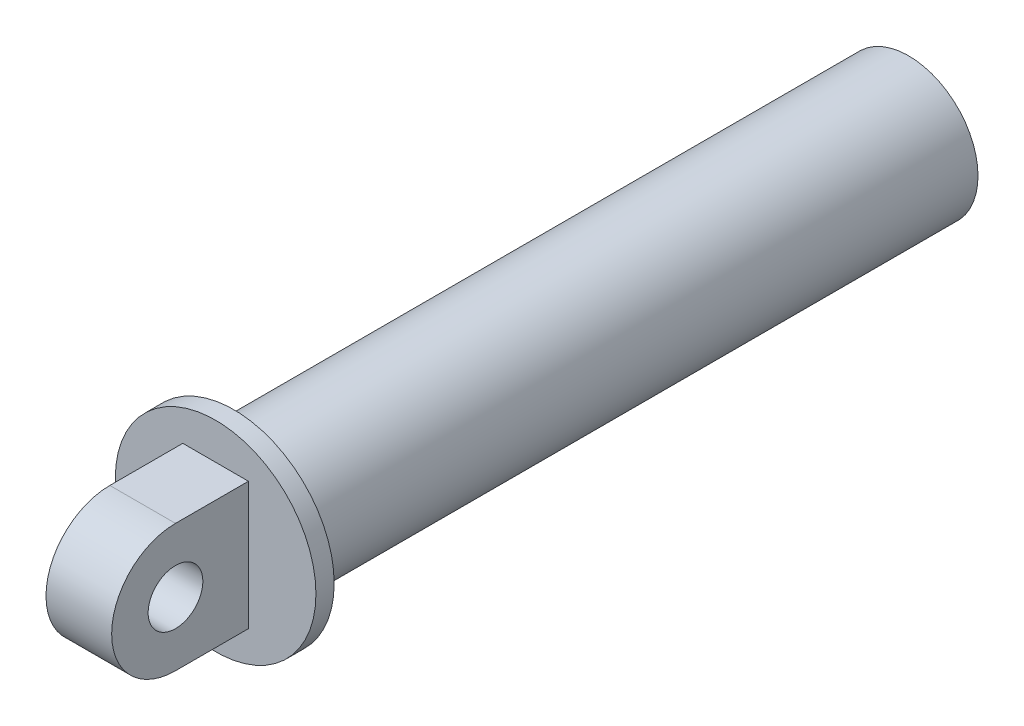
ISO-10303-21;
HEADER;
FILE_DESCRIPTION(('STEP AP214'),'2;1');
FILE_NAME('part.step','',(''),(''),'','','');
FILE_SCHEMA(('AUTOMOTIVE_DESIGN { 1 0 10303 214 1 1 1 1 }'));
ENDSEC;
DATA;
#1=APPLICATION_CONTEXT('core data for automotive mechanical design processes');
#2=APPLICATION_PROTOCOL_DEFINITION('international standard','automotive_design',2000,#1);
#3=PRODUCT_CONTEXT('',#1,'mechanical');
#4=PRODUCT('Part','Part','',(#3));
#5=PRODUCT_RELATED_PRODUCT_CATEGORY('part','',(#4));
#6=PRODUCT_DEFINITION_FORMATION('','',#4);
#7=PRODUCT_DEFINITION_CONTEXT('part definition',#1,'design');
#8=PRODUCT_DEFINITION('design','',#6,#7);
#9=PRODUCT_DEFINITION_SHAPE('','',#8);
#10=(LENGTH_UNIT() NAMED_UNIT(*) SI_UNIT(.MILLI.,.METRE.));
#11=(NAMED_UNIT(*) PLANE_ANGLE_UNIT() SI_UNIT($,.RADIAN.));
#12=(NAMED_UNIT(*) SI_UNIT($,.STERADIAN.) SOLID_ANGLE_UNIT());
#13=UNCERTAINTY_MEASURE_WITH_UNIT(LENGTH_MEASURE(1.E-05),#10,'distance_accuracy_value','');
#14=(GEOMETRIC_REPRESENTATION_CONTEXT(3) GLOBAL_UNCERTAINTY_ASSIGNED_CONTEXT((#13)) GLOBAL_UNIT_ASSIGNED_CONTEXT((#10,
#11,#12)) REPRESENTATION_CONTEXT('',''));
#15=CARTESIAN_POINT('',(0.,0.,0.));
#16=DIRECTION('',(0.,0.,1.));
#17=DIRECTION('',(1.,0.,0.));
#18=AXIS2_PLACEMENT_3D('',#15,#16,#17);
#19=CARTESIAN_POINT('',(0.,0.,380.));
#20=DIRECTION('',(0.,0.,1.));
#21=DIRECTION('',(1.,0.,0.));
#22=AXIS2_PLACEMENT_3D('',#19,#20,#21);
#23=PLANE('',#22);
#24=CARTESIAN_POINT('',(0.,0.,380.));
#25=DIRECTION('',(0.,0.,1.));
#26=DIRECTION('',(1.,0.,0.));
#27=AXIS2_PLACEMENT_3D('',#24,#25,#26);
#28=CIRCLE('',#27,55.);
#29=CARTESIAN_POINT('',(55.,0.,380.));
#30=VERTEX_POINT('',#29);
#31=EDGE_CURVE('E125',#30,#30,#28,.T.);
#32=ORIENTED_EDGE('',*,*,#31,.T.);
#33=EDGE_LOOP('',(#32));
#34=FACE_BOUND('',#33,.T.);
#35=DIRECTION('',(0.,1.,0.));
#36=VECTOR('',#35,1.);
#37=CARTESIAN_POINT('',(18.,35.,380.));
#38=LINE('',#37,#36);
#39=CARTESIAN_POINT('',(18.,-35.,380.));
#40=VERTEX_POINT('',#39);
#41=CARTESIAN_POINT('',(18.,35.,380.));
#42=VERTEX_POINT('',#41);
#43=EDGE_CURVE('E116',#40,#42,#38,.T.);
#44=ORIENTED_EDGE('',*,*,#43,.F.);
#45=DIRECTION('',(-1.,0.,0.));
#46=VECTOR('',#45,1.);
#47=CARTESIAN_POINT('',(18.,-35.,380.));
#48=LINE('',#47,#46);
#49=CARTESIAN_POINT('',(-18.,-35.,380.));
#50=VERTEX_POINT('',#49);
#51=EDGE_CURVE('E98',#40,#50,#48,.T.);
#52=ORIENTED_EDGE('',*,*,#51,.T.);
#53=DIRECTION('',(0.,1.,0.));
#54=VECTOR('',#53,1.);
#55=CARTESIAN_POINT('',(-18.,35.,380.));
#56=LINE('',#55,#54);
#57=CARTESIAN_POINT('',(-18.,35.,380.));
#58=VERTEX_POINT('',#57);
#59=EDGE_CURVE('E86',#50,#58,#56,.T.);
#60=ORIENTED_EDGE('',*,*,#59,.T.);
#61=DIRECTION('',(-1.,0.,0.));
#62=VECTOR('',#61,1.);
#63=CARTESIAN_POINT('',(18.,35.,380.));
#64=LINE('',#63,#62);
#65=EDGE_CURVE('E120',#42,#58,#64,.T.);
#66=ORIENTED_EDGE('',*,*,#65,.F.);
#67=EDGE_LOOP('',(#44,#52,#60,#66));
#68=FACE_BOUND('',#67,.T.);
#69=ADVANCED_FACE('F39',(#34,#68),#23,.T.);
#70=CARTESIAN_POINT('',(0.,0.,0.));
#71=DIRECTION('',(0.,0.,1.));
#72=DIRECTION('',(1.,0.,0.));
#73=AXIS2_PLACEMENT_3D('',#70,#71,#72);
#74=PLANE('',#73);
#75=CARTESIAN_POINT('',(0.,0.,0.));
#76=DIRECTION('',(0.,0.,1.));
#77=DIRECTION('',(1.,0.,0.));
#78=AXIS2_PLACEMENT_3D('',#75,#76,#77);
#79=CIRCLE('',#78,38.);
#80=CARTESIAN_POINT('',(38.,0.,0.));
#81=VERTEX_POINT('',#80);
#82=EDGE_CURVE('E131',#81,#81,#79,.T.);
#83=ORIENTED_EDGE('',*,*,#82,.F.);
#84=EDGE_LOOP('',(#83));
#85=FACE_BOUND('',#84,.T.);
#86=CARTESIAN_POINT('',(0.,0.,0.));
#87=DIRECTION('',(0.,0.,1.));
#88=DIRECTION('',(1.,0.,0.));
#89=AXIS2_PLACEMENT_3D('',#86,#87,#88);
#90=CIRCLE('',#89,30.);
#91=CARTESIAN_POINT('',(30.,0.,0.));
#92=VERTEX_POINT('',#91);
#93=EDGE_CURVE('E128',#92,#92,#90,.T.);
#94=ORIENTED_EDGE('',*,*,#93,.T.);
#95=EDGE_LOOP('',(#94));
#96=FACE_BOUND('',#95,.T.);
#97=ADVANCED_FACE('F141',(#85,#96),#74,.F.);
#98=CARTESIAN_POINT('',(0.,0.,370.));
#99=DIRECTION('',(0.,0.,-1.));
#100=DIRECTION('',(-1.,0.,0.));
#101=AXIS2_PLACEMENT_3D('',#98,#99,#100);
#102=CYLINDRICAL_SURFACE('',#101,38.);
#103=CARTESIAN_POINT('',(0.,0.,370.));
#104=DIRECTION('',(0.,0.,1.));
#105=DIRECTION('',(1.,0.,0.));
#106=AXIS2_PLACEMENT_3D('',#103,#104,#105);
#107=CIRCLE('',#106,38.);
#108=CARTESIAN_POINT('',(38.,0.,370.));
#109=VERTEX_POINT('',#108);
#110=EDGE_CURVE('E47',#109,#109,#107,.T.);
#111=ORIENTED_EDGE('',*,*,#110,.F.);
#112=EDGE_LOOP('',(#111));
#113=FACE_BOUND('',#112,.T.);
#114=ORIENTED_EDGE('',*,*,#82,.T.);
#115=EDGE_LOOP('',(#114));
#116=FACE_BOUND('',#115,.T.);
#117=ADVANCED_FACE('F41',(#113,#116),#102,.T.);
#118=CARTESIAN_POINT('',(0.,0.,370.));
#119=DIRECTION('',(0.,0.,-1.));
#120=DIRECTION('',(-1.,0.,0.));
#121=AXIS2_PLACEMENT_3D('',#118,#119,#120);
#122=CYLINDRICAL_SURFACE('',#121,30.);
#123=CARTESIAN_POINT('',(0.,0.,350.));
#124=DIRECTION('',(0.,0.,-1.));
#125=DIRECTION('',(-1.,0.,0.));
#126=AXIS2_PLACEMENT_3D('',#123,#124,#125);
#127=CIRCLE('',#126,30.);
#128=CARTESIAN_POINT('',(-30.,0.,350.));
#129=VERTEX_POINT('',#128);
#130=EDGE_CURVE('E11',#129,#129,#127,.T.);
#131=ORIENTED_EDGE('',*,*,#130,.F.);
#132=EDGE_LOOP('',(#131));
#133=FACE_BOUND('',#132,.T.);
#134=ORIENTED_EDGE('',*,*,#93,.F.);
#135=EDGE_LOOP('',(#134));
#136=FACE_BOUND('',#135,.T.);
#137=ADVANCED_FACE('F140',(#133,#136),#122,.F.);
#138=CARTESIAN_POINT('',(0.,0.,370.));
#139=DIRECTION('',(0.,0.,1.));
#140=DIRECTION('',(1.,0.,0.));
#141=AXIS2_PLACEMENT_3D('',#138,#139,#140);
#142=PLANE('',#141);
#143=CARTESIAN_POINT('',(0.,0.,370.));
#144=DIRECTION('',(0.,0.,1.));
#145=DIRECTION('',(1.,0.,0.));
#146=AXIS2_PLACEMENT_3D('',#143,#144,#145);
#147=CIRCLE('',#146,55.);
#148=CARTESIAN_POINT('',(55.,0.,370.));
#149=VERTEX_POINT('',#148);
#150=EDGE_CURVE('E97',#149,#149,#147,.T.);
#151=ORIENTED_EDGE('',*,*,#150,.F.);
#152=EDGE_LOOP('',(#151));
#153=FACE_BOUND('',#152,.T.);
#154=ORIENTED_EDGE('',*,*,#110,.T.);
#155=EDGE_LOOP('',(#154));
#156=FACE_BOUND('',#155,.T.);
#157=ADVANCED_FACE('F136',(#153,#156),#142,.F.);
#158=CARTESIAN_POINT('',(0.,0.,380.));
#159=DIRECTION('',(0.,0.,-1.));
#160=DIRECTION('',(-1.,0.,0.));
#161=AXIS2_PLACEMENT_3D('',#158,#159,#160);
#162=CYLINDRICAL_SURFACE('',#161,55.);
#163=ORIENTED_EDGE('',*,*,#31,.F.);
#164=EDGE_LOOP('',(#163));
#165=FACE_BOUND('',#164,.T.);
#166=ORIENTED_EDGE('',*,*,#150,.T.);
#167=EDGE_LOOP('',(#166));
#168=FACE_BOUND('',#167,.T.);
#169=ADVANCED_FACE('F156',(#165,#168),#162,.T.);
#170=CARTESIAN_POINT('',(18.,0.,420.));
#171=DIRECTION('',(1.,0.,0.));
#172=DIRECTION('',(0.,0.,-1.));
#173=AXIS2_PLACEMENT_3D('',#170,#171,#172);
#174=PLANE('',#173);
#175=CARTESIAN_POINT('',(18.,0.,420.));
#176=DIRECTION('',(1.,0.,0.));
#177=DIRECTION('',(0.,0.,-1.));
#178=AXIS2_PLACEMENT_3D('',#175,#176,#177);
#179=CIRCLE('',#178,35.);
#180=CARTESIAN_POINT('',(18.,35.,420.));
#181=VERTEX_POINT('',#180);
#182=CARTESIAN_POINT('',(18.,-35.,420.));
#183=VERTEX_POINT('',#182);
#184=EDGE_CURVE('E113',#181,#183,#179,.T.);
#185=ORIENTED_EDGE('',*,*,#184,.T.);
#186=DIRECTION('',(0.,0.,-1.));
#187=VECTOR('',#186,1.);
#188=CARTESIAN_POINT('',(18.,-35.,380.));
#189=LINE('',#188,#187);
#190=EDGE_CURVE('E94',#183,#40,#189,.T.);
#191=ORIENTED_EDGE('',*,*,#190,.T.);
#192=ORIENTED_EDGE('',*,*,#43,.T.);
#193=DIRECTION('',(0.,0.,1.));
#194=VECTOR('',#193,1.);
#195=CARTESIAN_POINT('',(18.,35.,420.));
#196=LINE('',#195,#194);
#197=EDGE_CURVE('E54',#42,#181,#196,.T.);
#198=ORIENTED_EDGE('',*,*,#197,.T.);
#199=EDGE_LOOP('',(#185,#191,#192,#198));
#200=FACE_BOUND('',#199,.T.);
#201=CARTESIAN_POINT('',(18.,0.,420.));
#202=DIRECTION('',(1.,0.,0.));
#203=DIRECTION('',(0.,0.,-1.));
#204=AXIS2_PLACEMENT_3D('',#201,#202,#203);
#205=CIRCLE('',#204,15.);
#206=CARTESIAN_POINT('',(18.,0.,405.));
#207=VERTEX_POINT('',#206);
#208=EDGE_CURVE('E103',#207,#207,#205,.T.);
#209=ORIENTED_EDGE('',*,*,#208,.F.);
#210=EDGE_LOOP('',(#209));
#211=FACE_BOUND('',#210,.T.);
#212=ADVANCED_FACE('F170',(#200,#211),#174,.T.);
#213=CARTESIAN_POINT('',(-18.,0.,420.));
#214=DIRECTION('',(1.,0.,0.));
#215=DIRECTION('',(0.,0.,-1.));
#216=AXIS2_PLACEMENT_3D('',#213,#214,#215);
#217=PLANE('',#216);
#218=CARTESIAN_POINT('',(-18.,0.,420.));
#219=DIRECTION('',(1.,0.,0.));
#220=DIRECTION('',(0.,0.,-1.));
#221=AXIS2_PLACEMENT_3D('',#218,#219,#220);
#222=CIRCLE('',#221,35.);
#223=CARTESIAN_POINT('',(-18.,35.,420.));
#224=VERTEX_POINT('',#223);
#225=CARTESIAN_POINT('',(-18.,-35.,420.));
#226=VERTEX_POINT('',#225);
#227=EDGE_CURVE('E84',#224,#226,#222,.T.);
#228=ORIENTED_EDGE('',*,*,#227,.F.);
#229=DIRECTION('',(0.,0.,1.));
#230=VECTOR('',#229,1.);
#231=CARTESIAN_POINT('',(-18.,35.,420.));
#232=LINE('',#231,#230);
#233=EDGE_CURVE('E111',#58,#224,#232,.T.);
#234=ORIENTED_EDGE('',*,*,#233,.F.);
#235=ORIENTED_EDGE('',*,*,#59,.F.);
#236=DIRECTION('',(0.,0.,-1.));
#237=VECTOR('',#236,1.);
#238=CARTESIAN_POINT('',(-18.,-35.,380.));
#239=LINE('',#238,#237);
#240=EDGE_CURVE('E78',#226,#50,#239,.T.);
#241=ORIENTED_EDGE('',*,*,#240,.F.);
#242=EDGE_LOOP('',(#228,#234,#235,#241));
#243=FACE_BOUND('',#242,.T.);
#244=CARTESIAN_POINT('',(-18.,0.,420.));
#245=DIRECTION('',(1.,0.,0.));
#246=DIRECTION('',(0.,0.,-1.));
#247=AXIS2_PLACEMENT_3D('',#244,#245,#246);
#248=CIRCLE('',#247,15.);
#249=CARTESIAN_POINT('',(-18.,0.,405.));
#250=VERTEX_POINT('',#249);
#251=EDGE_CURVE('E106',#250,#250,#248,.T.);
#252=ORIENTED_EDGE('',*,*,#251,.T.);
#253=EDGE_LOOP('',(#252));
#254=FACE_BOUND('',#253,.T.);
#255=ADVANCED_FACE('F80',(#243,#254),#217,.F.);
#256=CARTESIAN_POINT('',(18.,0.,420.));
#257=DIRECTION('',(-1.,0.,0.));
#258=DIRECTION('',(0.,0.,1.));
#259=AXIS2_PLACEMENT_3D('',#256,#257,#258);
#260=CYLINDRICAL_SURFACE('',#259,35.);
#261=ORIENTED_EDGE('',*,*,#227,.T.);
#262=DIRECTION('',(-1.,0.,0.));
#263=VECTOR('',#262,1.);
#264=CARTESIAN_POINT('',(18.,-35.,420.));
#265=LINE('',#264,#263);
#266=EDGE_CURVE('E92',#183,#226,#265,.T.);
#267=ORIENTED_EDGE('',*,*,#266,.F.);
#268=ORIENTED_EDGE('',*,*,#184,.F.);
#269=DIRECTION('',(-1.,0.,0.));
#270=VECTOR('',#269,1.);
#271=CARTESIAN_POINT('',(18.,35.,420.));
#272=LINE('',#271,#270);
#273=EDGE_CURVE('E102',#181,#224,#272,.T.);
#274=ORIENTED_EDGE('',*,*,#273,.T.);
#275=EDGE_LOOP('',(#261,#267,#268,#274));
#276=FACE_BOUND('',#275,.T.);
#277=ADVANCED_FACE('F101',(#276),#260,.T.);
#278=CARTESIAN_POINT('',(18.,-35.,380.));
#279=DIRECTION('',(0.,1.,0.));
#280=DIRECTION('',(0.,0.,1.));
#281=AXIS2_PLACEMENT_3D('',#278,#279,#280);
#282=PLANE('',#281);
#283=ORIENTED_EDGE('',*,*,#240,.T.);
#284=ORIENTED_EDGE('',*,*,#51,.F.);
#285=ORIENTED_EDGE('',*,*,#190,.F.);
#286=ORIENTED_EDGE('',*,*,#266,.T.);
#287=EDGE_LOOP('',(#283,#284,#285,#286));
#288=FACE_BOUND('',#287,.T.);
#289=ADVANCED_FACE('F93',(#288),#282,.F.);
#290=CARTESIAN_POINT('',(18.,35.,420.));
#291=DIRECTION('',(0.,-1.,0.));
#292=DIRECTION('',(0.,0.,-1.));
#293=AXIS2_PLACEMENT_3D('',#290,#291,#292);
#294=PLANE('',#293);
#295=ORIENTED_EDGE('',*,*,#233,.T.);
#296=ORIENTED_EDGE('',*,*,#273,.F.);
#297=ORIENTED_EDGE('',*,*,#197,.F.);
#298=ORIENTED_EDGE('',*,*,#65,.T.);
#299=EDGE_LOOP('',(#295,#296,#297,#298));
#300=FACE_BOUND('',#299,.T.);
#301=ADVANCED_FACE('F185',(#300),#294,.F.);
#302=CARTESIAN_POINT('',(18.,0.,420.));
#303=DIRECTION('',(-1.,0.,0.));
#304=DIRECTION('',(0.,0.,1.));
#305=AXIS2_PLACEMENT_3D('',#302,#303,#304);
#306=CYLINDRICAL_SURFACE('',#305,15.);
#307=ORIENTED_EDGE('',*,*,#208,.T.);
#308=EDGE_LOOP('',(#307));
#309=FACE_BOUND('',#308,.T.);
#310=ORIENTED_EDGE('',*,*,#251,.F.);
#311=EDGE_LOOP('',(#310));
#312=FACE_BOUND('',#311,.T.);
#313=ADVANCED_FACE('F188',(#309,#312),#306,.F.);
#314=CARTESIAN_POINT('',(0.,0.,350.));
#315=DIRECTION('',(0.,0.,-1.));
#316=DIRECTION('',(-1.,0.,0.));
#317=AXIS2_PLACEMENT_3D('',#314,#315,#316);
#318=PLANE('',#317);
#319=ORIENTED_EDGE('',*,*,#130,.T.);
#320=EDGE_LOOP('',(#319));
#321=FACE_BOUND('',#320,.T.);
#322=ADVANCED_FACE('F207',(#321),#318,.T.);
#323=CLOSED_SHELL('',(#69,#97,#117,#137,#157,#169,#212,#255,#277,#289,#301,#313,#322));
#324=MANIFOLD_SOLID_BREP('B2',#323);
#325=ADVANCED_BREP_SHAPE_REPRESENTATION('',(#18,#324),#14);
#326=SHAPE_DEFINITION_REPRESENTATION(#9,#325);
ENDSEC;
END-ISO-10303-21;
